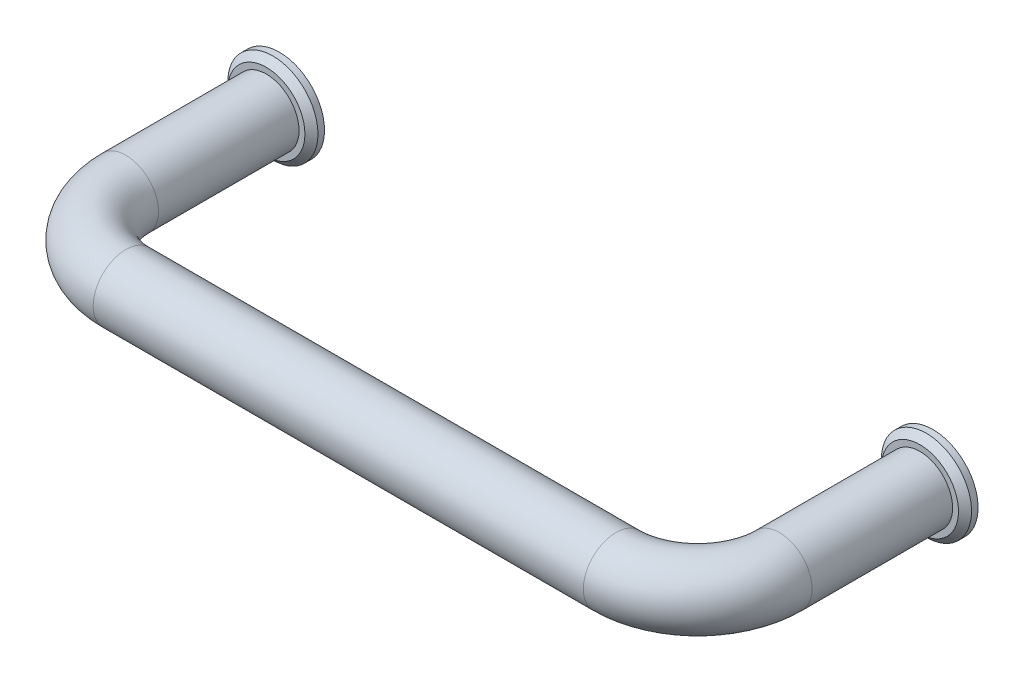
ISO-10303-21;
HEADER;
FILE_DESCRIPTION(('STEP AP214'),'2;1');
FILE_NAME('part.step','',(''),(''),'','','');
FILE_SCHEMA(('AUTOMOTIVE_DESIGN { 1 0 10303 214 1 1 1 1 }'));
ENDSEC;
DATA;
#1=APPLICATION_CONTEXT('core data for automotive mechanical design processes');
#2=APPLICATION_PROTOCOL_DEFINITION('international standard','automotive_design',2000,#1);
#3=PRODUCT_CONTEXT('',#1,'mechanical');
#4=PRODUCT('Part','Part','',(#3));
#5=PRODUCT_RELATED_PRODUCT_CATEGORY('part','',(#4));
#6=PRODUCT_DEFINITION_FORMATION('','',#4);
#7=PRODUCT_DEFINITION_CONTEXT('part definition',#1,'design');
#8=PRODUCT_DEFINITION('design','',#6,#7);
#9=PRODUCT_DEFINITION_SHAPE('','',#8);
#10=(LENGTH_UNIT() NAMED_UNIT(*) SI_UNIT(.MILLI.,.METRE.));
#11=(NAMED_UNIT(*) PLANE_ANGLE_UNIT() SI_UNIT($,.RADIAN.));
#12=(NAMED_UNIT(*) SI_UNIT($,.STERADIAN.) SOLID_ANGLE_UNIT());
#13=UNCERTAINTY_MEASURE_WITH_UNIT(LENGTH_MEASURE(1.E-05),#10,'distance_accuracy_value','');
#14=(GEOMETRIC_REPRESENTATION_CONTEXT(3) GLOBAL_UNCERTAINTY_ASSIGNED_CONTEXT((#13)) GLOBAL_UNIT_ASSIGNED_CONTEXT((#10,
#11,#12)) REPRESENTATION_CONTEXT('',''));
#15=CARTESIAN_POINT('',(0.,0.,0.));
#16=DIRECTION('',(0.,0.,1.));
#17=DIRECTION('',(1.,0.,0.));
#18=AXIS2_PLACEMENT_3D('',#15,#16,#17);
#19=CARTESIAN_POINT('',(0.,0.,0.));
#20=DIRECTION('',(0.,0.,-1.));
#21=DIRECTION('',(0.,1.,0.));
#22=AXIS2_PLACEMENT_3D('',#19,#20,#21);
#23=PLANE('',#22);
#24=CARTESIAN_POINT('',(0.,0.,0.));
#25=DIRECTION('',(0.,0.,1.));
#26=DIRECTION('',(1.,0.,0.));
#27=AXIS2_PLACEMENT_3D('',#24,#25,#26);
#28=CIRCLE('',#27,6.9);
#29=CARTESIAN_POINT('',(6.9,0.,-1.74183042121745E-13));
#30=VERTEX_POINT('',#29);
#31=EDGE_CURVE('E127',#30,#30,#28,.T.);
#32=ORIENTED_EDGE('',*,*,#31,.F.);
#33=EDGE_LOOP('',(#32));
#34=FACE_BOUND('',#33,.T.);
#35=CARTESIAN_POINT('',(0.,0.,0.));
#36=DIRECTION('',(0.,0.,-1.));
#37=DIRECTION('',(-1.,0.,0.));
#38=AXIS2_PLACEMENT_3D('',#35,#36,#37);
#39=CIRCLE('',#38,2.5);
#40=CARTESIAN_POINT('',(-2.5,0.,0.));
#41=VERTEX_POINT('',#40);
#42=EDGE_CURVE('E124',#41,#41,#39,.T.);
#43=ORIENTED_EDGE('',*,*,#42,.F.);
#44=EDGE_LOOP('',(#43));
#45=FACE_BOUND('',#44,.T.);
#46=ADVANCED_FACE('F12',(#34,#45),#23,.T.);
#47=CARTESIAN_POINT('',(100.,0.,0.));
#48=DIRECTION('',(0.,0.,1.));
#49=DIRECTION('',(0.,1.,0.));
#50=AXIS2_PLACEMENT_3D('',#47,#48,#49);
#51=PLANE('',#50);
#52=CARTESIAN_POINT('',(100.,0.,0.));
#53=DIRECTION('',(0.,0.,-1.));
#54=DIRECTION('',(-1.,0.,0.));
#55=AXIS2_PLACEMENT_3D('',#52,#53,#54);
#56=CIRCLE('',#55,6.9);
#57=CARTESIAN_POINT('',(93.1,0.,-1.74183042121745E-13));
#58=VERTEX_POINT('',#57);
#59=EDGE_CURVE('E45',#58,#58,#56,.T.);
#60=ORIENTED_EDGE('',*,*,#59,.T.);
#61=EDGE_LOOP('',(#60));
#62=FACE_BOUND('',#61,.T.);
#63=CARTESIAN_POINT('',(100.,0.,0.));
#64=DIRECTION('',(0.,0.,1.));
#65=DIRECTION('',(1.,0.,0.));
#66=AXIS2_PLACEMENT_3D('',#63,#64,#65);
#67=CIRCLE('',#66,2.5);
#68=CARTESIAN_POINT('',(102.5,0.,0.));
#69=VERTEX_POINT('',#68);
#70=EDGE_CURVE('E141',#69,#69,#67,.T.);
#71=ORIENTED_EDGE('',*,*,#70,.T.);
#72=EDGE_LOOP('',(#71));
#73=FACE_BOUND('',#72,.T.);
#74=ADVANCED_FACE('F70',(#62,#73),#51,.F.);
#75=CARTESIAN_POINT('',(0.,0.,23.5));
#76=DIRECTION('',(0.,0.,-1.));
#77=DIRECTION('',(0.,-1.,0.));
#78=AXIS2_PLACEMENT_3D('',#75,#76,#77);
#79=CYLINDRICAL_SURFACE('',#78,5.);
#80=CARTESIAN_POINT('',(0.,0.,1.99999999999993));
#81=DIRECTION('',(0.,0.,1.));
#82=DIRECTION('',(1.,0.,0.));
#83=AXIS2_PLACEMENT_3D('',#80,#81,#82);
#84=CIRCLE('',#83,5.);
#85=CARTESIAN_POINT('',(5.,0.,1.99999999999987));
#86=VERTEX_POINT('',#85);
#87=EDGE_CURVE('E8',#86,#86,#84,.F.);
#88=ORIENTED_EDGE('',*,*,#87,.F.);
#89=EDGE_LOOP('',(#88));
#90=FACE_BOUND('',#89,.T.);
#91=CARTESIAN_POINT('',(0.,0.,23.5));
#92=DIRECTION('',(0.,0.,-1.));
#93=DIRECTION('',(0.,1.,0.));
#94=AXIS2_PLACEMENT_3D('',#91,#92,#93);
#95=CIRCLE('',#94,5.);
#96=CARTESIAN_POINT('',(-5.,0.,23.5));
#97=VERTEX_POINT('',#96);
#98=EDGE_CURVE('E19',#97,#97,#95,.T.);
#99=ORIENTED_EDGE('',*,*,#98,.T.);
#100=EDGE_LOOP('',(#99));
#101=FACE_BOUND('',#100,.T.);
#102=ADVANCED_FACE('F14',(#90,#101),#79,.T.);
#103=CARTESIAN_POINT('',(12.5,0.,23.5));
#104=DIRECTION('',(0.,-1.,0.));
#105=DIRECTION('',(1.,0.,0.));
#106=AXIS2_PLACEMENT_3D('',#103,#104,#105);
#107=TOROIDAL_SURFACE('',#106,12.5,5.);
#108=CARTESIAN_POINT('',(12.5,0.,36.));
#109=DIRECTION('',(-1.,0.,0.));
#110=DIRECTION('',(0.,1.,0.));
#111=AXIS2_PLACEMENT_3D('',#108,#109,#110);
#112=CIRCLE('',#111,5.);
#113=CARTESIAN_POINT('',(12.5,0.,41.));
#114=VERTEX_POINT('',#113);
#115=EDGE_CURVE('E23',#114,#114,#112,.T.);
#116=CARTESIAN_POINT('',(12.5,0.,23.5));
#117=DIRECTION('',(0.,-1.,0.));
#118=DIRECTION('',(1.,0.,0.));
#119=AXIS2_PLACEMENT_3D('',#116,#117,#118);
#120=CIRCLE('',#119,17.5);
#121=EDGE_CURVE('',#114,#97,#120,.T.);
#122=ORIENTED_EDGE('',*,*,#115,.T.);
#123=ORIENTED_EDGE('',*,*,#98,.F.);
#124=ORIENTED_EDGE('',*,*,#121,.T.);
#125=ORIENTED_EDGE('',*,*,#121,.F.);
#126=EDGE_LOOP('',(#122,#124,#123,#125));
#127=FACE_BOUND('',#126,.T.);
#128=ADVANCED_FACE('F67',(#127),#107,.T.);
#129=CARTESIAN_POINT('',(87.5,0.,36.));
#130=DIRECTION('',(-1.,0.,0.));
#131=DIRECTION('',(0.,0.,1.));
#132=AXIS2_PLACEMENT_3D('',#129,#130,#131);
#133=CYLINDRICAL_SURFACE('',#132,5.);
#134=CARTESIAN_POINT('',(87.5,0.,36.));
#135=DIRECTION('',(-1.,0.,0.));
#136=DIRECTION('',(0.,1.,0.));
#137=AXIS2_PLACEMENT_3D('',#134,#135,#136);
#138=CIRCLE('',#137,5.);
#139=CARTESIAN_POINT('',(87.5,0.,41.));
#140=VERTEX_POINT('',#139);
#141=EDGE_CURVE('E28',#140,#140,#138,.T.);
#142=ORIENTED_EDGE('',*,*,#141,.T.);
#143=EDGE_LOOP('',(#142));
#144=FACE_BOUND('',#143,.T.);
#145=ORIENTED_EDGE('',*,*,#115,.F.);
#146=EDGE_LOOP('',(#145));
#147=FACE_BOUND('',#146,.T.);
#148=ADVANCED_FACE('F51',(#144,#147),#133,.T.);
#149=CARTESIAN_POINT('',(87.5,0.,23.5));
#150=DIRECTION('',(0.,-1.,0.));
#151=DIRECTION('',(1.,0.,0.));
#152=AXIS2_PLACEMENT_3D('',#149,#150,#151);
#153=TOROIDAL_SURFACE('',#152,12.5,5.);
#154=CARTESIAN_POINT('',(100.,0.,23.5));
#155=DIRECTION('',(0.,0.,1.));
#156=DIRECTION('',(0.,1.,0.));
#157=AXIS2_PLACEMENT_3D('',#154,#155,#156);
#158=CIRCLE('',#157,5.);
#159=CARTESIAN_POINT('',(105.,0.,23.5));
#160=VERTEX_POINT('',#159);
#161=EDGE_CURVE('E33',#160,#160,#158,.T.);
#162=CARTESIAN_POINT('',(87.5,0.,23.5));
#163=DIRECTION('',(0.,-1.,0.));
#164=DIRECTION('',(1.,0.,0.));
#165=AXIS2_PLACEMENT_3D('',#162,#163,#164);
#166=CIRCLE('',#165,17.5);
#167=EDGE_CURVE('',#160,#140,#166,.T.);
#168=ORIENTED_EDGE('',*,*,#161,.T.);
#169=ORIENTED_EDGE('',*,*,#141,.F.);
#170=ORIENTED_EDGE('',*,*,#167,.T.);
#171=ORIENTED_EDGE('',*,*,#167,.F.);
#172=EDGE_LOOP('',(#168,#170,#169,#171));
#173=FACE_BOUND('',#172,.T.);
#174=ADVANCED_FACE('F54',(#173),#153,.T.);
#175=CARTESIAN_POINT('',(100.,0.,23.5));
#176=DIRECTION('',(0.,0.,-1.));
#177=DIRECTION('',(-1.,0.,0.));
#178=AXIS2_PLACEMENT_3D('',#175,#176,#177);
#179=CYLINDRICAL_SURFACE('',#178,5.);
#180=CARTESIAN_POINT('',(100.,0.,1.99999999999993));
#181=DIRECTION('',(0.,0.,1.));
#182=DIRECTION('',(1.,0.,0.));
#183=AXIS2_PLACEMENT_3D('',#180,#181,#182);
#184=CIRCLE('',#183,5.);
#185=CARTESIAN_POINT('',(105.,0.,2.));
#186=VERTEX_POINT('',#185);
#187=EDGE_CURVE('E31',#186,#186,#184,.T.);
#188=ORIENTED_EDGE('',*,*,#187,.T.);
#189=EDGE_LOOP('',(#188));
#190=FACE_BOUND('',#189,.T.);
#191=ORIENTED_EDGE('',*,*,#161,.F.);
#192=EDGE_LOOP('',(#191));
#193=FACE_BOUND('',#192,.T.);
#194=ADVANCED_FACE('F56',(#190,#193),#179,.T.);
#195=CARTESIAN_POINT('',(105.9,0.,2.));
#196=DIRECTION('',(0.,0.,1.));
#197=DIRECTION('',(1.,0.,0.));
#198=AXIS2_PLACEMENT_3D('',#195,#196,#197);
#199=PLANE('',#198);
#200=CARTESIAN_POINT('',(100.,0.,1.99999999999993));
#201=DIRECTION('',(0.,0.,-1.));
#202=DIRECTION('',(-1.,0.,0.));
#203=AXIS2_PLACEMENT_3D('',#200,#201,#202);
#204=CIRCLE('',#203,5.9);
#205=CARTESIAN_POINT('',(94.1,0.,1.99999999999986));
#206=VERTEX_POINT('',#205);
#207=EDGE_CURVE('E40',#206,#206,#204,.T.);
#208=ORIENTED_EDGE('',*,*,#207,.F.);
#209=EDGE_LOOP('',(#208));
#210=FACE_BOUND('',#209,.T.);
#211=ORIENTED_EDGE('',*,*,#187,.F.);
#212=EDGE_LOOP('',(#211));
#213=FACE_BOUND('',#212,.T.);
#214=ADVANCED_FACE('F65',(#210,#213),#199,.T.);
#215=CARTESIAN_POINT('',(100.,0.,0.));
#216=DIRECTION('',(0.,0.,-1.));
#217=DIRECTION('',(-1.,0.,0.));
#218=AXIS2_PLACEMENT_3D('',#215,#216,#217);
#219=CYLINDRICAL_SURFACE('',#218,6.9);
#220=CARTESIAN_POINT('',(100.,0.,0.999999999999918));
#221=DIRECTION('',(0.,0.,-1.));
#222=DIRECTION('',(-1.,0.,0.));
#223=AXIS2_PLACEMENT_3D('',#220,#221,#222);
#224=CIRCLE('',#223,6.9);
#225=CARTESIAN_POINT('',(93.1,0.,0.999999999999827));
#226=VERTEX_POINT('',#225);
#227=EDGE_CURVE('E34',#226,#226,#224,.T.);
#228=ORIENTED_EDGE('',*,*,#227,.T.);
#229=EDGE_LOOP('',(#228));
#230=FACE_BOUND('',#229,.T.);
#231=ORIENTED_EDGE('',*,*,#59,.F.);
#232=EDGE_LOOP('',(#231));
#233=FACE_BOUND('',#232,.T.);
#234=ADVANCED_FACE('F82',(#230,#233),#219,.T.);
#235=CARTESIAN_POINT('',(100.,0.,0.999999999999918));
#236=DIRECTION('',(0.,0.,-1.));
#237=DIRECTION('',(-1.,0.,0.));
#238=AXIS2_PLACEMENT_3D('',#235,#236,#237);
#239=CONICAL_SURFACE('',#238,6.9,0.785398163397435);
#240=ORIENTED_EDGE('',*,*,#207,.T.);
#241=EDGE_LOOP('',(#240));
#242=FACE_BOUND('',#241,.T.);
#243=ORIENTED_EDGE('',*,*,#227,.F.);
#244=EDGE_LOOP('',(#243));
#245=FACE_BOUND('',#244,.T.);
#246=ADVANCED_FACE('F85',(#242,#245),#239,.T.);
#247=CARTESIAN_POINT('',(100.,0.,14.6933830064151));
#248=DIRECTION('',(0.,0.,1.));
#249=DIRECTION('',(1.,0.,0.));
#250=AXIS2_PLACEMENT_3D('',#247,#248,#249);
#251=CYLINDRICAL_SURFACE('',#250,2.5);
#252=CARTESIAN_POINT('',(100.,0.,11.));
#253=DIRECTION('',(0.,0.,1.));
#254=DIRECTION('',(1.,0.,0.));
#255=AXIS2_PLACEMENT_3D('',#252,#253,#254);
#256=CIRCLE('',#255,2.5);
#257=CARTESIAN_POINT('',(102.5,0.,11.));
#258=VERTEX_POINT('',#257);
#259=EDGE_CURVE('E138',#258,#258,#256,.T.);
#260=ORIENTED_EDGE('',*,*,#259,.T.);
#261=EDGE_LOOP('',(#260));
#262=FACE_BOUND('',#261,.T.);
#263=ORIENTED_EDGE('',*,*,#70,.F.);
#264=EDGE_LOOP('',(#263));
#265=FACE_BOUND('',#264,.T.);
#266=ADVANCED_FACE('F88',(#262,#265),#251,.F.);
#267=CARTESIAN_POINT('',(102.5,0.,11.));
#268=DIRECTION('',(0.,0.,-1.));
#269=DIRECTION('',(-1.,0.,0.));
#270=AXIS2_PLACEMENT_3D('',#267,#268,#269);
#271=PLANE('',#270);
#272=ORIENTED_EDGE('',*,*,#259,.F.);
#273=EDGE_LOOP('',(#272));
#274=FACE_BOUND('',#273,.T.);
#275=ADVANCED_FACE('F95',(#274),#271,.T.);
#276=CARTESIAN_POINT('',(0.,0.,0.));
#277=DIRECTION('',(0.,0.,-1.));
#278=DIRECTION('',(1.,0.,0.));
#279=AXIS2_PLACEMENT_3D('',#276,#277,#278);
#280=CYLINDRICAL_SURFACE('',#279,6.9);
#281=CARTESIAN_POINT('',(0.,0.,0.999999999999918));
#282=DIRECTION('',(0.,0.,1.));
#283=DIRECTION('',(1.,0.,0.));
#284=AXIS2_PLACEMENT_3D('',#281,#282,#283);
#285=CIRCLE('',#284,6.9);
#286=CARTESIAN_POINT('',(6.9,0.,0.999999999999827));
#287=VERTEX_POINT('',#286);
#288=EDGE_CURVE('E135',#287,#287,#285,.T.);
#289=ORIENTED_EDGE('',*,*,#288,.F.);
#290=EDGE_LOOP('',(#289));
#291=FACE_BOUND('',#290,.T.);
#292=ORIENTED_EDGE('',*,*,#31,.T.);
#293=EDGE_LOOP('',(#292));
#294=FACE_BOUND('',#293,.T.);
#295=ADVANCED_FACE('F99',(#291,#294),#280,.T.);
#296=CARTESIAN_POINT('',(0.,0.,0.999999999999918));
#297=DIRECTION('',(0.,0.,-1.));
#298=DIRECTION('',(1.,0.,0.));
#299=AXIS2_PLACEMENT_3D('',#296,#297,#298);
#300=CONICAL_SURFACE('',#299,6.9,0.785398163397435);
#301=CARTESIAN_POINT('',(0.,0.,1.99999999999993));
#302=DIRECTION('',(0.,0.,1.));
#303=DIRECTION('',(1.,0.,0.));
#304=AXIS2_PLACEMENT_3D('',#301,#302,#303);
#305=CIRCLE('',#304,5.9);
#306=CARTESIAN_POINT('',(5.9,0.,1.99999999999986));
#307=VERTEX_POINT('',#306);
#308=EDGE_CURVE('E132',#307,#307,#305,.T.);
#309=ORIENTED_EDGE('',*,*,#308,.F.);
#310=EDGE_LOOP('',(#309));
#311=FACE_BOUND('',#310,.T.);
#312=ORIENTED_EDGE('',*,*,#288,.T.);
#313=EDGE_LOOP('',(#312));
#314=FACE_BOUND('',#313,.T.);
#315=ADVANCED_FACE('F103',(#311,#314),#300,.T.);
#316=CARTESIAN_POINT('',(-5.9,0.,2.));
#317=DIRECTION('',(0.,0.,1.));
#318=DIRECTION('',(-1.,0.,0.));
#319=AXIS2_PLACEMENT_3D('',#316,#317,#318);
#320=PLANE('',#319);
#321=ORIENTED_EDGE('',*,*,#87,.T.);
#322=EDGE_LOOP('',(#321));
#323=FACE_BOUND('',#322,.T.);
#324=ORIENTED_EDGE('',*,*,#308,.T.);
#325=EDGE_LOOP('',(#324));
#326=FACE_BOUND('',#325,.T.);
#327=ADVANCED_FACE('F107',(#323,#326),#320,.T.);
#328=CARTESIAN_POINT('',(0.,0.,14.6933830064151));
#329=DIRECTION('',(0.,0.,1.));
#330=DIRECTION('',(-1.,0.,0.));
#331=AXIS2_PLACEMENT_3D('',#328,#329,#330);
#332=CYLINDRICAL_SURFACE('',#331,2.5);
#333=CARTESIAN_POINT('',(0.,0.,11.));
#334=DIRECTION('',(0.,0.,-1.));
#335=DIRECTION('',(-1.,0.,0.));
#336=AXIS2_PLACEMENT_3D('',#333,#334,#335);
#337=CIRCLE('',#336,2.5);
#338=CARTESIAN_POINT('',(-2.5,0.,11.));
#339=VERTEX_POINT('',#338);
#340=EDGE_CURVE('E123',#339,#339,#337,.T.);
#341=ORIENTED_EDGE('',*,*,#340,.F.);
#342=EDGE_LOOP('',(#341));
#343=FACE_BOUND('',#342,.T.);
#344=ORIENTED_EDGE('',*,*,#42,.T.);
#345=EDGE_LOOP('',(#344));
#346=FACE_BOUND('',#345,.T.);
#347=ADVANCED_FACE('F111',(#343,#346),#332,.F.);
#348=CARTESIAN_POINT('',(-2.5,0.,11.));
#349=DIRECTION('',(0.,0.,-1.));
#350=DIRECTION('',(1.,0.,0.));
#351=AXIS2_PLACEMENT_3D('',#348,#349,#350);
#352=PLANE('',#351);
#353=ORIENTED_EDGE('',*,*,#340,.T.);
#354=EDGE_LOOP('',(#353));
#355=FACE_BOUND('',#354,.T.);
#356=ADVANCED_FACE('F114',(#355),#352,.T.);
#357=CLOSED_SHELL('',(#46,#74,#102,#128,#148,#174,#194,#214,#234,#246,#266,#275,#295,#315,#327,
#347,#356));
#358=MANIFOLD_SOLID_BREP('B1',#357);
#359=ADVANCED_BREP_SHAPE_REPRESENTATION('',(#18,#358),#14);
#360=SHAPE_DEFINITION_REPRESENTATION(#9,#359);
ENDSEC;
END-ISO-10303-21;
